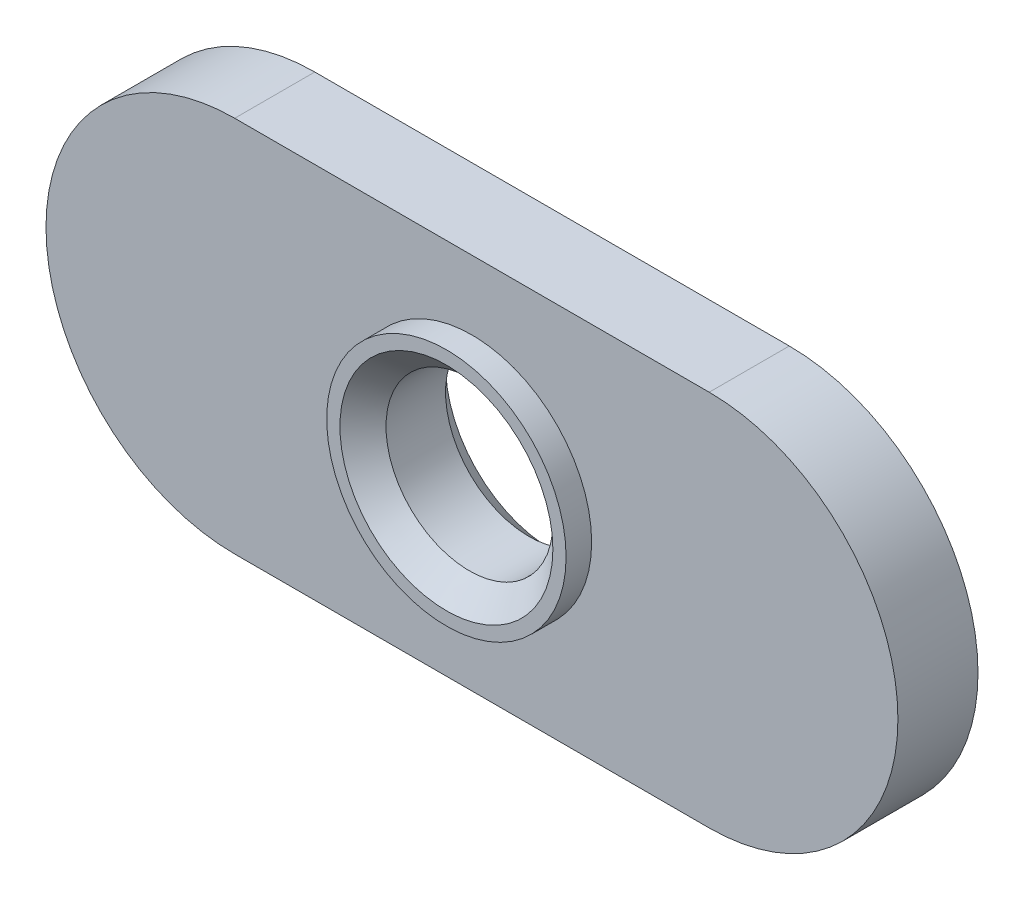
from build123d import *

# Parameters (mm, degrees)
BOSS_EXTRUDE1_DEPTH      = 1.1938
BOSS_EXTRUDE1_DEPTH_BACK = 1.1938
SKETCH2_R                = 3.5687
BOSS_EXTRUDE2_DEPTH      = 1.9558


with BuildPart() as part:
    # Sketch1 → Boss-Extrude1 (new, two sides: drawn at the far end of the back side and taken through both)
    with BuildSketch(Plane.XY.offset(-BOSS_EXTRUDE1_DEPTH_BACK)):
        with BuildLine():
            Line((-7.0739, -5.6261), (7.0739, -5.6261))
            ThreePointArc((7.0739, -5.6261), (12.7, 0), (7.0739, 5.6261))
            Line((7.0739, 5.6261), (-7.0739, 5.6261))
            ThreePointArc((-7.0739, 5.6261), (-12.7, 0), (-7.0739, -5.6261))
        make_face()
    extrude(amount=BOSS_EXTRUDE1_DEPTH + BOSS_EXTRUDE1_DEPTH_BACK)

    # Sketch2 → Boss-Extrude2 (add)
    with BuildSketch(Plane.XY):
        Circle(SKETCH2_R)
    extrude(amount=BOSS_EXTRUDE2_DEPTH)

    # Sketch3 → Cut-Revolve1 (revolve, cut)
    with BuildSketch(Plane(origin=(0, 0, 0), x_dir=(0, 0, -1), z_dir=(1, 0, 0)), mode=Mode.PRIVATE) as cut_revolve1_sk:
        Polygon((-1.9558, 0), (-1.9558, 3.175), (-1.26873, 2.48793), (0.50673, 2.48793), (1.1938, 3.175), (1.1938, 0), align=None)
    revolve(cut_revolve1_sk.sketch.rotate(Axis((0, 0, -1.1938), (0, 0, 1)), 270), axis=Axis((0, 0, -1.1938), (0, 0, 1)), mode=Mode.SUBTRACT)


solid = part.part
